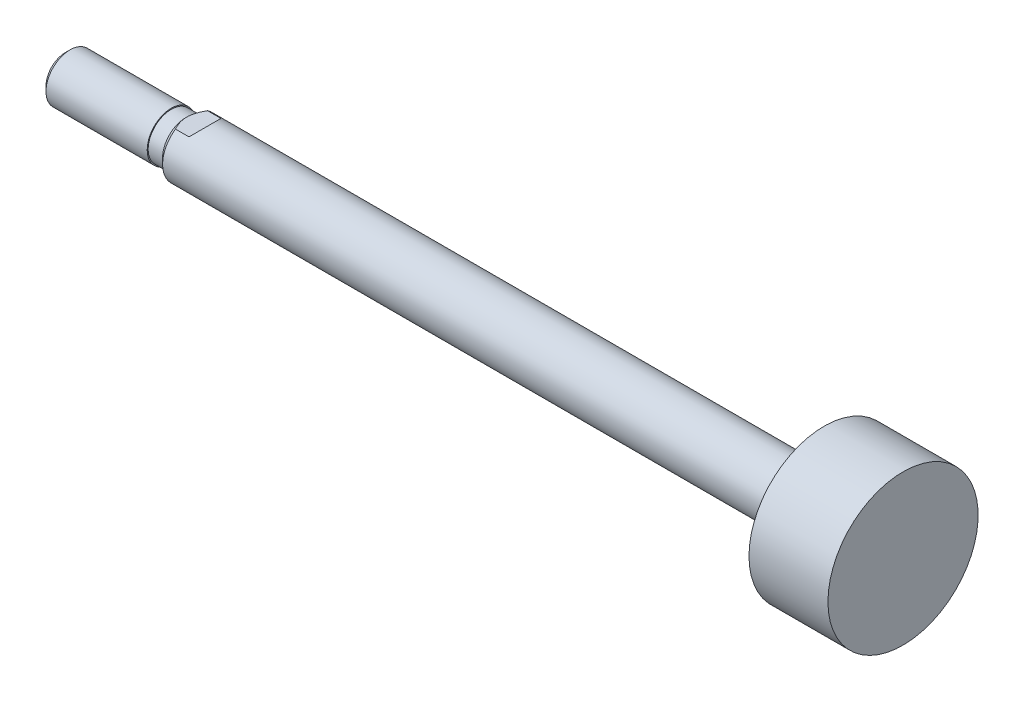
ISO-10303-21;
HEADER;
FILE_DESCRIPTION(('STEP AP214'),'2;1');
FILE_NAME('part.step','',(''),(''),'','','');
FILE_SCHEMA(('AUTOMOTIVE_DESIGN { 1 0 10303 214 1 1 1 1 }'));
ENDSEC;
DATA;
#1=APPLICATION_CONTEXT('core data for automotive mechanical design processes');
#2=APPLICATION_PROTOCOL_DEFINITION('international standard','automotive_design',2000,#1);
#3=PRODUCT_CONTEXT('',#1,'mechanical');
#4=PRODUCT('Part','Part','',(#3));
#5=PRODUCT_RELATED_PRODUCT_CATEGORY('part','',(#4));
#6=PRODUCT_DEFINITION_FORMATION('','',#4);
#7=PRODUCT_DEFINITION_CONTEXT('part definition',#1,'design');
#8=PRODUCT_DEFINITION('design','',#6,#7);
#9=PRODUCT_DEFINITION_SHAPE('','',#8);
#10=(LENGTH_UNIT() NAMED_UNIT(*) SI_UNIT(.MILLI.,.METRE.));
#11=(NAMED_UNIT(*) PLANE_ANGLE_UNIT() SI_UNIT($,.RADIAN.));
#12=(NAMED_UNIT(*) SI_UNIT($,.STERADIAN.) SOLID_ANGLE_UNIT());
#13=UNCERTAINTY_MEASURE_WITH_UNIT(LENGTH_MEASURE(1.E-05),#10,'distance_accuracy_value','');
#14=(GEOMETRIC_REPRESENTATION_CONTEXT(3) GLOBAL_UNCERTAINTY_ASSIGNED_CONTEXT((#13)) GLOBAL_UNIT_ASSIGNED_CONTEXT((#10,
#11,#12)) REPRESENTATION_CONTEXT('',''));
#15=CARTESIAN_POINT('',(0.,0.,0.));
#16=DIRECTION('',(0.,0.,1.));
#17=DIRECTION('',(1.,0.,0.));
#18=AXIS2_PLACEMENT_3D('',#15,#16,#17);
#19=CARTESIAN_POINT('',(-16.,0.,0.));
#20=DIRECTION('',(1.,0.,0.));
#21=DIRECTION('',(0.,0.,-1.));
#22=AXIS2_PLACEMENT_3D('',#19,#20,#21);
#23=PLANE('',#22);
#24=CARTESIAN_POINT('',(-16.,0.,0.));
#25=DIRECTION('',(-1.,0.,0.));
#26=DIRECTION('',(0.,0.,1.));
#27=AXIS2_PLACEMENT_3D('',#24,#25,#26);
#28=CIRCLE('',#27,2.0095);
#29=CARTESIAN_POINT('',(-16.,0.,2.0095));
#30=VERTEX_POINT('',#29);
#31=EDGE_CURVE('E61',#30,#30,#28,.T.);
#32=ORIENTED_EDGE('',*,*,#31,.T.);
#33=EDGE_LOOP('',(#32));
#34=FACE_BOUND('',#33,.T.);
#35=ADVANCED_FACE('F16',(#34),#23,.F.);
#36=CARTESIAN_POINT('',(-15.5095,0.,0.));
#37=DIRECTION('',(1.,0.,0.));
#38=DIRECTION('',(0.,0.,-1.));
#39=AXIS2_PLACEMENT_3D('',#36,#37,#38);
#40=CONICAL_SURFACE('',#39,2.5,0.785398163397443);
#41=ORIENTED_EDGE('',*,*,#31,.F.);
#42=EDGE_LOOP('',(#41));
#43=FACE_BOUND('',#42,.T.);
#44=CARTESIAN_POINT('',(-15.5095,0.,0.));
#45=DIRECTION('',(-1.,0.,0.));
#46=DIRECTION('',(0.,0.,1.));
#47=AXIS2_PLACEMENT_3D('',#44,#45,#46);
#48=CIRCLE('',#47,2.5);
#49=CARTESIAN_POINT('',(-15.5095,0.,2.5));
#50=VERTEX_POINT('',#49);
#51=EDGE_CURVE('E141',#50,#50,#48,.T.);
#52=ORIENTED_EDGE('',*,*,#51,.T.);
#53=EDGE_LOOP('',(#52));
#54=FACE_BOUND('',#53,.T.);
#55=ADVANCED_FACE('F131',(#43,#54),#40,.T.);
#56=CARTESIAN_POINT('',(71.,0.,0.));
#57=DIRECTION('',(-1.,0.,0.));
#58=DIRECTION('',(0.,0.,1.));
#59=AXIS2_PLACEMENT_3D('',#56,#57,#58);
#60=CYLINDRICAL_SURFACE('',#59,2.5);
#61=ORIENTED_EDGE('',*,*,#51,.F.);
#62=EDGE_LOOP('',(#61));
#63=FACE_BOUND('',#62,.T.);
#64=CARTESIAN_POINT('',(-5.,0.,0.));
#65=DIRECTION('',(-1.,0.,0.));
#66=DIRECTION('',(0.,0.,1.));
#67=AXIS2_PLACEMENT_3D('',#64,#65,#66);
#68=CIRCLE('',#67,2.5);
#69=CARTESIAN_POINT('',(-5.,0.,2.5));
#70=VERTEX_POINT('',#69);
#71=EDGE_CURVE('E144',#70,#70,#68,.T.);
#72=ORIENTED_EDGE('',*,*,#71,.T.);
#73=EDGE_LOOP('',(#72));
#74=FACE_BOUND('',#73,.T.);
#75=ADVANCED_FACE('F137',(#63,#74),#60,.T.);
#76=CARTESIAN_POINT('',(-5.,2.5,0.));
#77=DIRECTION('',(-1.,0.,0.));
#78=DIRECTION('',(0.,0.,1.));
#79=AXIS2_PLACEMENT_3D('',#76,#77,#78);
#80=PLANE('',#79);
#81=ORIENTED_EDGE('',*,*,#71,.F.);
#82=EDGE_LOOP('',(#81));
#83=FACE_BOUND('',#82,.T.);
#84=CARTESIAN_POINT('',(-5.,0.,0.));
#85=DIRECTION('',(-1.,0.,0.));
#86=DIRECTION('',(0.,0.,1.));
#87=AXIS2_PLACEMENT_3D('',#84,#85,#86);
#88=CIRCLE('',#87,2.4);
#89=CARTESIAN_POINT('',(-5.,0.,2.4));
#90=VERTEX_POINT('',#89);
#91=EDGE_CURVE('E149',#90,#90,#88,.T.);
#92=ORIENTED_EDGE('',*,*,#91,.T.);
#93=EDGE_LOOP('',(#92));
#94=FACE_BOUND('',#93,.T.);
#95=ADVANCED_FACE('F174',(#83,#94),#80,.F.);
#96=CARTESIAN_POINT('',(71.,0.,0.));
#97=DIRECTION('',(-1.,0.,0.));
#98=DIRECTION('',(0.,0.,1.));
#99=AXIS2_PLACEMENT_3D('',#96,#97,#98);
#100=CYLINDRICAL_SURFACE('',#99,2.4);
#101=ORIENTED_EDGE('',*,*,#91,.F.);
#102=EDGE_LOOP('',(#101));
#103=FACE_BOUND('',#102,.T.);
#104=CARTESIAN_POINT('',(-3.5,0.,0.));
#105=DIRECTION('',(-1.,0.,0.));
#106=DIRECTION('',(0.,0.,1.));
#107=AXIS2_PLACEMENT_3D('',#104,#105,#106);
#108=CIRCLE('',#107,2.4);
#109=CARTESIAN_POINT('',(-3.5,0.,2.4));
#110=VERTEX_POINT('',#109);
#111=EDGE_CURVE('E152',#110,#110,#108,.T.);
#112=ORIENTED_EDGE('',*,*,#111,.T.);
#113=EDGE_LOOP('',(#112));
#114=FACE_BOUND('',#113,.T.);
#115=ADVANCED_FACE('F128',(#103,#114),#100,.T.);
#116=CARTESIAN_POINT('',(-2.9,0.,0.));
#117=DIRECTION('',(1.,0.,0.));
#118=DIRECTION('',(0.,0.,-1.));
#119=AXIS2_PLACEMENT_3D('',#116,#117,#118);
#120=CONICAL_SURFACE('',#119,3.,0.785398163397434);
#121=ORIENTED_EDGE('',*,*,#111,.F.);
#122=EDGE_LOOP('',(#121));
#123=FACE_BOUND('',#122,.T.);
#124=CARTESIAN_POINT('',(-2.9,0.,0.));
#125=DIRECTION('',(-1.,0.,0.));
#126=DIRECTION('',(0.,0.,1.));
#127=AXIS2_PLACEMENT_3D('',#124,#125,#126);
#128=CIRCLE('',#127,3.);
#129=CARTESIAN_POINT('',(-2.9,-2.5,1.6583123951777));
#130=VERTEX_POINT('',#129);
#131=CARTESIAN_POINT('',(-2.9,2.5,1.6583123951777));
#132=VERTEX_POINT('',#131);
#133=EDGE_CURVE('E72',#130,#132,#128,.T.);
#134=ORIENTED_EDGE('',*,*,#133,.T.);
#135=CARTESIAN_POINT('',(-0.425228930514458,2.5,-4.87063838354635));
#136=CARTESIAN_POINT('',(-0.525399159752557,2.5,-4.75802584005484));
#137=CARTESIAN_POINT('',(-0.625183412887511,2.5,-4.64506665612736));
#138=CARTESIAN_POINT('',(-0.823773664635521,2.5,-4.4182710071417));
#139=CARTESIAN_POINT('',(-0.92257955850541,2.5,-4.30443445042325));
#140=CARTESIAN_POINT('',(-1.11941059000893,2.5,-4.07522880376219));
#141=CARTESIAN_POINT('',(-1.21743049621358,2.5,-3.95985521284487));
#142=CARTESIAN_POINT('',(-1.41193695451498,2.5,-3.72782983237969));
#143=CARTESIAN_POINT('',(-1.50842358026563,2.5,-3.61117810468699));
#144=CARTESIAN_POINT('',(-1.70521529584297,2.5,-3.36919546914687));
#145=CARTESIAN_POINT('',(-1.80539924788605,2.5,-3.24376574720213));
#146=CARTESIAN_POINT('',(-2.00286377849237,2.5,-2.99064359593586));
#147=CARTESIAN_POINT('',(-2.10014454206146,2.5,-2.86295131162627));
#148=CARTESIAN_POINT('',(-2.29060058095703,2.5,-2.60486889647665));
#149=CARTESIAN_POINT('',(-2.38378268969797,2.5,-2.47448383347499));
#150=CARTESIAN_POINT('',(-2.56464061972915,2.5,-2.20996951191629));
#151=CARTESIAN_POINT('',(-2.6523184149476,2.5,-2.07584162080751));
#152=CARTESIAN_POINT('',(-2.79440770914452,2.5,-1.84400231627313));
#153=CARTESIAN_POINT('',(-2.85085955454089,2.5,-1.74754764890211));
#154=CARTESIAN_POINT('',(-2.95868902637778,2.5,-1.55177170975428));
#155=CARTESIAN_POINT('',(-3.01006506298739,2.5,-1.45244955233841));
#156=CARTESIAN_POINT('',(-3.10565683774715,2.5,-1.25143988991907));
#157=CARTESIAN_POINT('',(-3.1499310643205,2.5,-1.14978053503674));
#158=CARTESIAN_POINT('',(-3.22973308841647,2.5,-0.943074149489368));
#159=CARTESIAN_POINT('',(-3.26526648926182,2.5,-0.838029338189));
#160=CARTESIAN_POINT('',(-3.31562586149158,2.5,-0.658681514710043));
#161=CARTESIAN_POINT('',(-3.33344377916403,2.5,-0.585220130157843));
#162=CARTESIAN_POINT('',(-3.36311350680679,2.5,-0.437094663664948));
#163=CARTESIAN_POINT('',(-3.3749663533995,2.5,-0.362430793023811));
#164=CARTESIAN_POINT('',(-3.39207613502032,2.5,-0.212600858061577));
#165=CARTESIAN_POINT('',(-3.39735563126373,2.5,-0.137437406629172));
#166=CARTESIAN_POINT('',(-3.40109770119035,2.5,0.0130627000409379));
#167=CARTESIAN_POINT('',(-3.39956023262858,2.5,0.0883993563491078));
#168=CARTESIAN_POINT('',(-3.38978184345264,2.5,0.238239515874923));
#169=CARTESIAN_POINT('',(-3.38157544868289,2.5,0.312745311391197));
#170=CARTESIAN_POINT('',(-3.35893973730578,2.5,0.460809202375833));
#171=CARTESIAN_POINT('',(-3.3445089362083,2.5,0.534367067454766));
#172=CARTESIAN_POINT('',(-3.30990502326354,2.5,0.680975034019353));
#173=CARTESIAN_POINT('',(-3.28966927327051,2.5,0.754010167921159));
#174=CARTESIAN_POINT('',(-3.24432243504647,2.5,0.898516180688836));
#175=CARTESIAN_POINT('',(-3.21921226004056,2.5,0.969987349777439));
#176=CARTESIAN_POINT('',(-3.15554804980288,2.5,1.1356557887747));
#177=CARTESIAN_POINT('',(-3.1153405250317,2.5,1.22921487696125));
#178=CARTESIAN_POINT('',(-3.02915225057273,2.5,1.41365514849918));
#179=CARTESIAN_POINT('',(-2.98316829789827,2.5,1.50453481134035));
#180=CARTESIAN_POINT('',(-2.88656384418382,2.5,1.68420740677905));
#181=CARTESIAN_POINT('',(-2.83592691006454,2.5,1.77299143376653));
#182=CARTESIAN_POINT('',(-2.73117089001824,2.5,1.94844240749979));
#183=CARTESIAN_POINT('',(-2.67705248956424,2.5,2.03510976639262));
#184=CARTESIAN_POINT('',(-2.56885191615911,2.5,2.20236354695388));
#185=CARTESIAN_POINT('',(-2.51490373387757,2.5,2.28303710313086));
#186=CARTESIAN_POINT('',(-2.40500978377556,2.5,2.44301727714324));
#187=CARTESIAN_POINT('',(-2.34906385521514,2.5,2.52232378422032));
#188=CARTESIAN_POINT('',(-2.23605769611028,2.5,2.67906748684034));
#189=CARTESIAN_POINT('',(-2.17901176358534,2.5,2.75651502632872));
#190=CARTESIAN_POINT('',(-2.06361307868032,2.5,2.91039941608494));
#191=CARTESIAN_POINT('',(-2.00526067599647,2.5,2.98683652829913));
#192=CARTESIAN_POINT('',(-1.9463811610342,2.5,3.06285845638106));
#193=B_SPLINE_CURVE_WITH_KNOTS('',3,(#135,#136,#137,#138,#139,#140,#141,#142,#143,#144,#145,
#146,#147,#148,#149,#150,#151,#152,#153,#154,#155,#156,#157,#158,#159,#160,#161,#162,#163,#164,
#165,#166,#167,#168,#169,#170,#171,#172,#173,#174,#175,#176,#177,#178,#179,#180,#181,#182,#183,
#184,#185,#186,#187,#188,#189,#190,#191,#192),.UNSPECIFIED.,.F.,.F.,(4,2,2,2,2,2,2,2,2,2,2,2,2,
2,2,2,2,2,2,2,2,2,2,2,2,2,2,2,4),(0.,0.452154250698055,0.904356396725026,1.35851609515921,
1.81265391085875,2.29420857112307,2.77573247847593,3.25642052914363,3.73693520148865,
4.07210288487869,4.40737521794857,4.73972626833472,5.07186370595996,5.29842779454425,
5.52495249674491,5.75069755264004,5.9764440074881,6.20102913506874,6.42566785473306,
6.65282810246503,6.87994583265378,7.18517787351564,7.49057991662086,7.79710536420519,
8.10357064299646,8.39468383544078,8.68582050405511,8.9743730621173,9.26284928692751),.UNSPECIFIED.);
#194=CARTESIAN_POINT('',(-2.9,2.5,-1.6583123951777));
#195=VERTEX_POINT('',#194);
#196=EDGE_CURVE('E82',#132,#195,#193,.F.);
#197=ORIENTED_EDGE('',*,*,#196,.T.);
#198=CARTESIAN_POINT('',(-2.89999999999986,-2.5,-1.65831239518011));
#199=VERTEX_POINT('',#198);
#200=EDGE_CURVE('E155',#195,#199,#128,.T.);
#201=ORIENTED_EDGE('',*,*,#200,.T.);
#202=CARTESIAN_POINT('',(-0.425228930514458,-2.5,-4.87063838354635));
#203=CARTESIAN_POINT('',(-0.525399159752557,-2.5,-4.75802584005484));
#204=CARTESIAN_POINT('',(-0.625183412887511,-2.5,-4.64506665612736));
#205=CARTESIAN_POINT('',(-0.823773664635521,-2.5,-4.4182710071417));
#206=CARTESIAN_POINT('',(-0.92257955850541,-2.5,-4.30443445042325));
#207=CARTESIAN_POINT('',(-1.11941059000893,-2.5,-4.07522880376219));
#208=CARTESIAN_POINT('',(-1.21743049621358,-2.5,-3.95985521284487));
#209=CARTESIAN_POINT('',(-1.41193695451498,-2.5,-3.72782983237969));
#210=CARTESIAN_POINT('',(-1.50842358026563,-2.5,-3.61117810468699));
#211=CARTESIAN_POINT('',(-1.70521529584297,-2.5,-3.36919546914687));
#212=CARTESIAN_POINT('',(-1.80539924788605,-2.5,-3.24376574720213));
#213=CARTESIAN_POINT('',(-2.00286377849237,-2.5,-2.99064359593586));
#214=CARTESIAN_POINT('',(-2.10014454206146,-2.5,-2.86295131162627));
#215=CARTESIAN_POINT('',(-2.29060058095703,-2.5,-2.60486889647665));
#216=CARTESIAN_POINT('',(-2.38378268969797,-2.5,-2.47448383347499));
#217=CARTESIAN_POINT('',(-2.56464061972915,-2.5,-2.20996951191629));
#218=CARTESIAN_POINT('',(-2.6523184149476,-2.5,-2.07584162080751));
#219=CARTESIAN_POINT('',(-2.79440770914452,-2.5,-1.84400231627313));
#220=CARTESIAN_POINT('',(-2.85085955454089,-2.5,-1.74754764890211));
#221=CARTESIAN_POINT('',(-2.95868902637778,-2.5,-1.55177170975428));
#222=CARTESIAN_POINT('',(-3.01006506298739,-2.5,-1.45244955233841));
#223=CARTESIAN_POINT('',(-3.10565683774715,-2.5,-1.25143988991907));
#224=CARTESIAN_POINT('',(-3.1499310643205,-2.5,-1.14978053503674));
#225=CARTESIAN_POINT('',(-3.22973308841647,-2.5,-0.943074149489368));
#226=CARTESIAN_POINT('',(-3.26526648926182,-2.5,-0.838029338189));
#227=CARTESIAN_POINT('',(-3.31562586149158,-2.5,-0.658681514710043));
#228=CARTESIAN_POINT('',(-3.33344377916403,-2.5,-0.585220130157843));
#229=CARTESIAN_POINT('',(-3.36311350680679,-2.5,-0.437094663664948));
#230=CARTESIAN_POINT('',(-3.3749663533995,-2.5,-0.362430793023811));
#231=CARTESIAN_POINT('',(-3.39207613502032,-2.5,-0.212600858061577));
#232=CARTESIAN_POINT('',(-3.39735563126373,-2.5,-0.137437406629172));
#233=CARTESIAN_POINT('',(-3.40109770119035,-2.5,0.0130627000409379));
#234=CARTESIAN_POINT('',(-3.39956023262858,-2.5,0.0883993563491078));
#235=CARTESIAN_POINT('',(-3.38978184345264,-2.5,0.238239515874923));
#236=CARTESIAN_POINT('',(-3.38157544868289,-2.5,0.312745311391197));
#237=CARTESIAN_POINT('',(-3.35893973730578,-2.5,0.460809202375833));
#238=CARTESIAN_POINT('',(-3.3445089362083,-2.5,0.534367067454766));
#239=CARTESIAN_POINT('',(-3.30990502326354,-2.5,0.680975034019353));
#240=CARTESIAN_POINT('',(-3.28966927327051,-2.5,0.754010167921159));
#241=CARTESIAN_POINT('',(-3.24432243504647,-2.5,0.898516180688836));
#242=CARTESIAN_POINT('',(-3.21921226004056,-2.5,0.969987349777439));
#243=CARTESIAN_POINT('',(-3.15554804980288,-2.5,1.1356557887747));
#244=CARTESIAN_POINT('',(-3.1153405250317,-2.5,1.22921487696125));
#245=CARTESIAN_POINT('',(-3.02915225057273,-2.5,1.41365514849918));
#246=CARTESIAN_POINT('',(-2.98316829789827,-2.5,1.50453481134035));
#247=CARTESIAN_POINT('',(-2.88656384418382,-2.5,1.68420740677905));
#248=CARTESIAN_POINT('',(-2.83592691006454,-2.5,1.77299143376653));
#249=CARTESIAN_POINT('',(-2.73117089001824,-2.5,1.94844240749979));
#250=CARTESIAN_POINT('',(-2.67705248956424,-2.5,2.03510976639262));
#251=CARTESIAN_POINT('',(-2.56885191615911,-2.5,2.20236354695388));
#252=CARTESIAN_POINT('',(-2.51490373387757,-2.5,2.28303710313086));
#253=CARTESIAN_POINT('',(-2.40500978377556,-2.5,2.44301727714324));
#254=CARTESIAN_POINT('',(-2.34906385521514,-2.5,2.52232378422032));
#255=CARTESIAN_POINT('',(-2.23605769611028,-2.5,2.67906748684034));
#256=CARTESIAN_POINT('',(-2.17901176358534,-2.5,2.75651502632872));
#257=CARTESIAN_POINT('',(-2.06361307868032,-2.5,2.91039941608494));
#258=CARTESIAN_POINT('',(-2.00526067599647,-2.5,2.98683652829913));
#259=CARTESIAN_POINT('',(-1.9463811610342,-2.5,3.06285845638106));
#260=B_SPLINE_CURVE_WITH_KNOTS('',3,(#202,#203,#204,#205,#206,#207,#208,#209,#210,#211,#212,
#213,#214,#215,#216,#217,#218,#219,#220,#221,#222,#223,#224,#225,#226,#227,#228,#229,#230,#231,
#232,#233,#234,#235,#236,#237,#238,#239,#240,#241,#242,#243,#244,#245,#246,#247,#248,#249,#250,
#251,#252,#253,#254,#255,#256,#257,#258,#259),.UNSPECIFIED.,.F.,.F.,(4,2,2,2,2,2,2,2,2,2,2,2,2,
2,2,2,2,2,2,2,2,2,2,2,2,2,2,2,4),(0.,0.452154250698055,0.904356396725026,1.35851609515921,
1.81265391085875,2.29420857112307,2.77573247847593,3.25642052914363,3.73693520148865,
4.07210288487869,4.40737521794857,4.73972626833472,5.07186370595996,5.29842779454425,
5.52495249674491,5.75069755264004,5.9764440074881,6.20102913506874,6.42566785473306,
6.65282810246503,6.87994583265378,7.18517787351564,7.49057991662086,7.79710536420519,
8.10357064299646,8.39468383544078,8.68582050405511,8.9743730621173,9.26284928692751),.UNSPECIFIED.);
#261=EDGE_CURVE('E84',#199,#130,#260,.T.);
#262=ORIENTED_EDGE('',*,*,#261,.T.);
#263=EDGE_LOOP('',(#134,#197,#201,#262));
#264=FACE_BOUND('',#263,.T.);
#265=ADVANCED_FACE('F100',(#123,#264),#120,.T.);
#266=CARTESIAN_POINT('',(71.,0.,0.));
#267=DIRECTION('',(-1.,0.,0.));
#268=DIRECTION('',(0.,0.,1.));
#269=AXIS2_PLACEMENT_3D('',#266,#267,#268);
#270=CYLINDRICAL_SURFACE('',#269,3.);
#271=CARTESIAN_POINT('',(-4.,0.,0.));
#272=DIRECTION('',(0.707106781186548,-0.707106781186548,0.));
#273=DIRECTION('',(-0.707106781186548,-0.707106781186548,0.));
#274=AXIS2_PLACEMENT_3D('',#271,#272,#273);
#275=ELLIPSE('',#274,4.24264068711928,3.);
#276=CARTESIAN_POINT('',(-1.5,2.5,-1.6583123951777));
#277=VERTEX_POINT('',#276);
#278=CARTESIAN_POINT('',(-1.5,2.5,1.6583123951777));
#279=VERTEX_POINT('',#278);
#280=EDGE_CURVE('E23',#277,#279,#275,.T.);
#281=ORIENTED_EDGE('',*,*,#280,.T.);
#282=DIRECTION('',(-1.,0.,0.));
#283=VECTOR('',#282,1.);
#284=CARTESIAN_POINT('',(71.,2.5,1.6583123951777));
#285=LINE('',#284,#283);
#286=EDGE_CURVE('E11',#279,#132,#285,.T.);
#287=ORIENTED_EDGE('',*,*,#286,.T.);
#288=ORIENTED_EDGE('',*,*,#133,.F.);
#289=DIRECTION('',(-1.,0.,0.));
#290=VECTOR('',#289,1.);
#291=CARTESIAN_POINT('',(71.,-2.5,1.6583123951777));
#292=LINE('',#291,#290);
#293=CARTESIAN_POINT('',(-1.5,-2.5,1.6583123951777));
#294=VERTEX_POINT('',#293);
#295=EDGE_CURVE('E65',#130,#294,#292,.F.);
#296=ORIENTED_EDGE('',*,*,#295,.T.);
#297=CARTESIAN_POINT('',(-4.,0.,0.));
#298=DIRECTION('',(0.707106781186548,0.707106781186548,0.));
#299=DIRECTION('',(-0.707106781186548,0.707106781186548,0.));
#300=AXIS2_PLACEMENT_3D('',#297,#298,#299);
#301=ELLIPSE('',#300,4.24264068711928,3.);
#302=CARTESIAN_POINT('',(-1.5,-2.5,-1.6583123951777));
#303=VERTEX_POINT('',#302);
#304=EDGE_CURVE('E55',#294,#303,#301,.T.);
#305=ORIENTED_EDGE('',*,*,#304,.T.);
#306=DIRECTION('',(-1.,0.,0.));
#307=VECTOR('',#306,1.);
#308=CARTESIAN_POINT('',(71.,-2.5,-1.6583123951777));
#309=LINE('',#308,#307);
#310=EDGE_CURVE('E60',#303,#199,#309,.T.);
#311=ORIENTED_EDGE('',*,*,#310,.T.);
#312=ORIENTED_EDGE('',*,*,#200,.F.);
#313=DIRECTION('',(-1.,0.,0.));
#314=VECTOR('',#313,1.);
#315=CARTESIAN_POINT('',(71.,2.5,-1.6583123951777));
#316=LINE('',#315,#314);
#317=EDGE_CURVE('E73',#195,#277,#316,.F.);
#318=ORIENTED_EDGE('',*,*,#317,.T.);
#319=EDGE_LOOP('',(#281,#287,#288,#296,#305,#311,#312,#318));
#320=FACE_BOUND('',#319,.T.);
#321=CARTESIAN_POINT('',(62.8,0.,0.));
#322=DIRECTION('',(-1.,0.,0.));
#323=DIRECTION('',(0.,0.,1.));
#324=AXIS2_PLACEMENT_3D('',#321,#322,#323);
#325=CIRCLE('',#324,3.);
#326=CARTESIAN_POINT('',(62.8,0.,3.));
#327=VERTEX_POINT('',#326);
#328=EDGE_CURVE('E157',#327,#327,#325,.T.);
#329=ORIENTED_EDGE('',*,*,#328,.T.);
#330=EDGE_LOOP('',(#329));
#331=FACE_BOUND('',#330,.T.);
#332=ADVANCED_FACE('F69',(#320,#331),#270,.T.);
#333=CARTESIAN_POINT('',(62.8,3.,0.));
#334=DIRECTION('',(1.,0.,0.));
#335=DIRECTION('',(0.,0.,-1.));
#336=AXIS2_PLACEMENT_3D('',#333,#334,#335);
#337=PLANE('',#336);
#338=ORIENTED_EDGE('',*,*,#328,.F.);
#339=EDGE_LOOP('',(#338));
#340=FACE_BOUND('',#339,.T.);
#341=CARTESIAN_POINT('',(62.8,0.,0.));
#342=DIRECTION('',(-1.,0.,0.));
#343=DIRECTION('',(0.,0.,1.));
#344=AXIS2_PLACEMENT_3D('',#341,#342,#343);
#345=CIRCLE('',#344,7.8);
#346=CARTESIAN_POINT('',(62.8,0.,7.8));
#347=VERTEX_POINT('',#346);
#348=EDGE_CURVE('E160',#347,#347,#345,.T.);
#349=ORIENTED_EDGE('',*,*,#348,.T.);
#350=EDGE_LOOP('',(#349));
#351=FACE_BOUND('',#350,.T.);
#352=ADVANCED_FACE('F118',(#340,#351),#337,.F.);
#353=CARTESIAN_POINT('',(71.,0.,0.));
#354=DIRECTION('',(-1.,0.,0.));
#355=DIRECTION('',(0.,0.,1.));
#356=AXIS2_PLACEMENT_3D('',#353,#354,#355);
#357=CYLINDRICAL_SURFACE('',#356,7.8);
#358=ORIENTED_EDGE('',*,*,#348,.F.);
#359=EDGE_LOOP('',(#358));
#360=FACE_BOUND('',#359,.T.);
#361=CARTESIAN_POINT('',(71.,0.,0.));
#362=DIRECTION('',(-1.,0.,0.));
#363=DIRECTION('',(0.,0.,1.));
#364=AXIS2_PLACEMENT_3D('',#361,#362,#363);
#365=CIRCLE('',#364,7.8);
#366=CARTESIAN_POINT('',(71.,0.,7.8));
#367=VERTEX_POINT('',#366);
#368=EDGE_CURVE('E162',#367,#367,#365,.T.);
#369=ORIENTED_EDGE('',*,*,#368,.T.);
#370=EDGE_LOOP('',(#369));
#371=FACE_BOUND('',#370,.T.);
#372=ADVANCED_FACE('F114',(#360,#371),#357,.T.);
#373=CARTESIAN_POINT('',(71.,7.8,0.));
#374=DIRECTION('',(-1.,0.,0.));
#375=DIRECTION('',(0.,0.,1.));
#376=AXIS2_PLACEMENT_3D('',#373,#374,#375);
#377=PLANE('',#376);
#378=ORIENTED_EDGE('',*,*,#368,.F.);
#379=EDGE_LOOP('',(#378));
#380=FACE_BOUND('',#379,.T.);
#381=ADVANCED_FACE('F111',(#380),#377,.F.);
#382=CARTESIAN_POINT('',(-1.,-3.,-6.));
#383=DIRECTION('',(0.707106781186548,0.707106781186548,0.));
#384=DIRECTION('',(-0.707106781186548,0.707106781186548,0.));
#385=AXIS2_PLACEMENT_3D('',#382,#383,#384);
#386=PLANE('',#385);
#387=DIRECTION('',(0.,0.,1.));
#388=VECTOR('',#387,1.);
#389=CARTESIAN_POINT('',(-1.5,-2.5,-6.));
#390=LINE('',#389,#388);
#391=EDGE_CURVE('E37',#303,#294,#390,.T.);
#392=ORIENTED_EDGE('',*,*,#391,.F.);
#393=ORIENTED_EDGE('',*,*,#304,.F.);
#394=EDGE_LOOP('',(#392,#393));
#395=FACE_BOUND('',#394,.T.);
#396=ADVANCED_FACE('F56',(#395),#386,.F.);
#397=CARTESIAN_POINT('',(-1.5,-2.5,-6.));
#398=DIRECTION('',(0.,1.,0.));
#399=DIRECTION('',(0.,0.,1.));
#400=AXIS2_PLACEMENT_3D('',#397,#398,#399);
#401=PLANE('',#400);
#402=ORIENTED_EDGE('',*,*,#391,.T.);
#403=ORIENTED_EDGE('',*,*,#295,.F.);
#404=ORIENTED_EDGE('',*,*,#261,.F.);
#405=ORIENTED_EDGE('',*,*,#310,.F.);
#406=EDGE_LOOP('',(#402,#403,#404,#405));
#407=FACE_BOUND('',#406,.T.);
#408=ADVANCED_FACE('F64',(#407),#401,.F.);
#409=CARTESIAN_POINT('',(-1.5,2.5,-6.));
#410=DIRECTION('',(0.707106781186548,-0.707106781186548,0.));
#411=DIRECTION('',(0.707106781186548,0.707106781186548,0.));
#412=AXIS2_PLACEMENT_3D('',#409,#410,#411);
#413=PLANE('',#412);
#414=DIRECTION('',(0.,0.,1.));
#415=VECTOR('',#414,1.);
#416=CARTESIAN_POINT('',(-1.5,2.5,-6.));
#417=LINE('',#416,#415);
#418=EDGE_CURVE('E30',#277,#279,#417,.T.);
#419=ORIENTED_EDGE('',*,*,#418,.T.);
#420=ORIENTED_EDGE('',*,*,#280,.F.);
#421=EDGE_LOOP('',(#419,#420));
#422=FACE_BOUND('',#421,.T.);
#423=ADVANCED_FACE('F83',(#422),#413,.F.);
#424=CARTESIAN_POINT('',(-18.5,2.5,-6.));
#425=DIRECTION('',(0.,-1.,0.));
#426=DIRECTION('',(0.,0.,-1.));
#427=AXIS2_PLACEMENT_3D('',#424,#425,#426);
#428=PLANE('',#427);
#429=ORIENTED_EDGE('',*,*,#418,.F.);
#430=ORIENTED_EDGE('',*,*,#317,.F.);
#431=ORIENTED_EDGE('',*,*,#196,.F.);
#432=ORIENTED_EDGE('',*,*,#286,.F.);
#433=EDGE_LOOP('',(#429,#430,#431,#432));
#434=FACE_BOUND('',#433,.T.);
#435=ADVANCED_FACE('F80',(#434),#428,.F.);
#436=CLOSED_SHELL('',(#35,#55,#75,#95,#115,#265,#332,#352,#372,#381,#396,#408,#423,#435));
#437=MANIFOLD_SOLID_BREP('B1',#436);
#438=ADVANCED_BREP_SHAPE_REPRESENTATION('',(#18,#437),#14);
#439=SHAPE_DEFINITION_REPRESENTATION(#9,#438);
ENDSEC;
END-ISO-10303-21;
